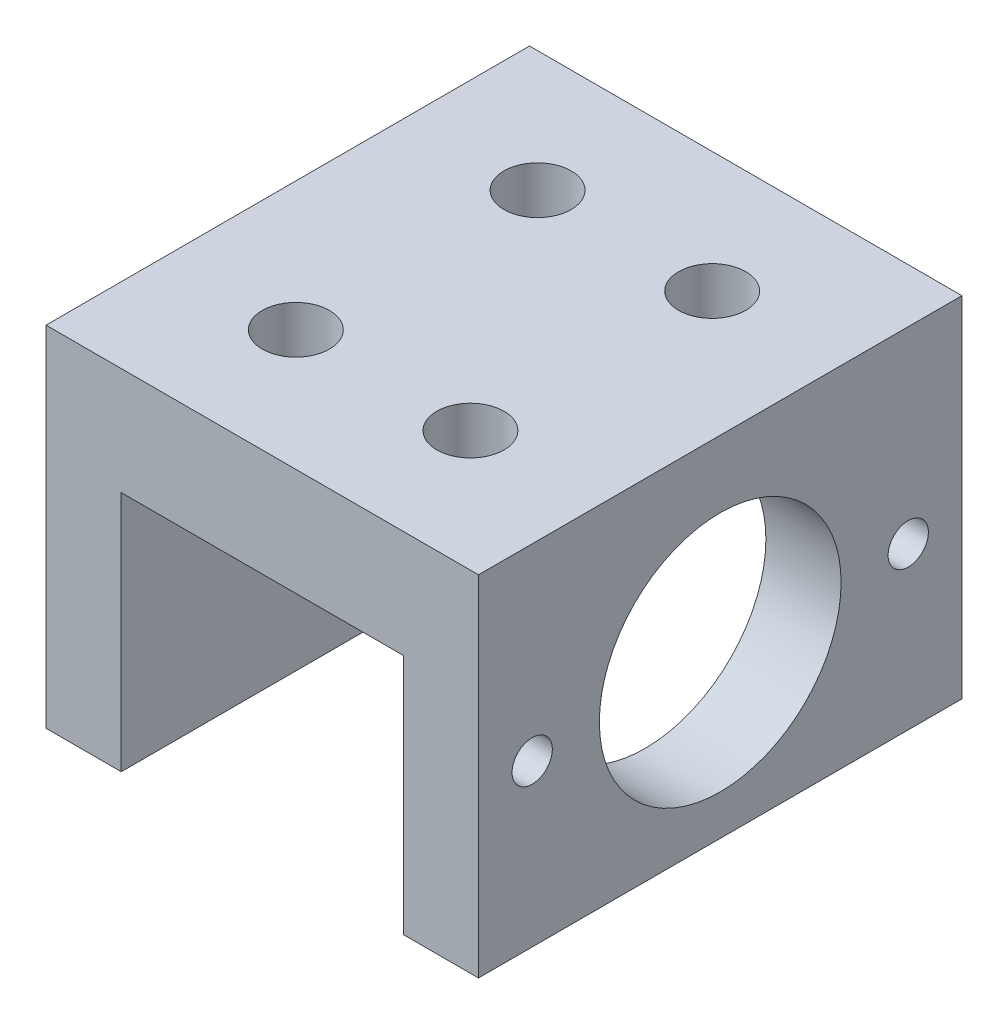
ISO-10303-21;
HEADER;
FILE_DESCRIPTION(('STEP AP214'),'2;1');
FILE_NAME('part.step','',(''),(''),'','','');
FILE_SCHEMA(('AUTOMOTIVE_DESIGN { 1 0 10303 214 1 1 1 1 }'));
ENDSEC;
DATA;
#1=APPLICATION_CONTEXT('core data for automotive mechanical design processes');
#2=APPLICATION_PROTOCOL_DEFINITION('international standard','automotive_design',2000,#1);
#3=PRODUCT_CONTEXT('',#1,'mechanical');
#4=PRODUCT('Part','Part','',(#3));
#5=PRODUCT_RELATED_PRODUCT_CATEGORY('part','',(#4));
#6=PRODUCT_DEFINITION_FORMATION('','',#4);
#7=PRODUCT_DEFINITION_CONTEXT('part definition',#1,'design');
#8=PRODUCT_DEFINITION('design','',#6,#7);
#9=PRODUCT_DEFINITION_SHAPE('','',#8);
#10=(LENGTH_UNIT() NAMED_UNIT(*) SI_UNIT(.MILLI.,.METRE.));
#11=(NAMED_UNIT(*) PLANE_ANGLE_UNIT() SI_UNIT($,.RADIAN.));
#12=(NAMED_UNIT(*) SI_UNIT($,.STERADIAN.) SOLID_ANGLE_UNIT());
#13=UNCERTAINTY_MEASURE_WITH_UNIT(LENGTH_MEASURE(1.E-05),#10,'distance_accuracy_value','');
#14=(GEOMETRIC_REPRESENTATION_CONTEXT(3) GLOBAL_UNCERTAINTY_ASSIGNED_CONTEXT((#13)) GLOBAL_UNIT_ASSIGNED_CONTEXT((#10,
#11,#12)) REPRESENTATION_CONTEXT('',''));
#15=CARTESIAN_POINT('',(0.,0.,0.));
#16=DIRECTION('',(0.,0.,1.));
#17=DIRECTION('',(1.,0.,0.));
#18=AXIS2_PLACEMENT_3D('',#15,#16,#17);
#19=CARTESIAN_POINT('',(0.,-26.,0.));
#20=DIRECTION('',(0.,1.,0.));
#21=DIRECTION('',(0.,0.,1.));
#22=AXIS2_PLACEMENT_3D('',#19,#20,#21);
#23=PLANE('',#22);
#24=DIRECTION('',(1.,0.,0.));
#25=VECTOR('',#24,1.);
#26=CARTESIAN_POINT('',(-16.1,-26.,18.));
#27=LINE('',#26,#25);
#28=CARTESIAN_POINT('',(10.5,-26.,18.));
#29=VERTEX_POINT('',#28);
#30=CARTESIAN_POINT('',(16.1,-26.,18.));
#31=VERTEX_POINT('',#30);
#32=EDGE_CURVE('E149',#29,#31,#27,.T.);
#33=ORIENTED_EDGE('',*,*,#32,.F.);
#34=DIRECTION('',(0.,0.,-1.));
#35=VECTOR('',#34,1.);
#36=CARTESIAN_POINT('',(10.5,-26.,18.));
#37=LINE('',#36,#35);
#38=CARTESIAN_POINT('',(10.5,-26.,-18.));
#39=VERTEX_POINT('',#38);
#40=EDGE_CURVE('E159',#29,#39,#37,.T.);
#41=ORIENTED_EDGE('',*,*,#40,.T.);
#42=DIRECTION('',(-1.,0.,0.));
#43=VECTOR('',#42,1.);
#44=CARTESIAN_POINT('',(16.1,-26.,-18.));
#45=LINE('',#44,#43);
#46=CARTESIAN_POINT('',(16.1,-26.,-18.));
#47=VERTEX_POINT('',#46);
#48=EDGE_CURVE('E153',#47,#39,#45,.T.);
#49=ORIENTED_EDGE('',*,*,#48,.F.);
#50=DIRECTION('',(0.,0.,-1.));
#51=VECTOR('',#50,1.);
#52=CARTESIAN_POINT('',(16.1,-26.,18.));
#53=LINE('',#52,#51);
#54=EDGE_CURVE('E136',#31,#47,#53,.T.);
#55=ORIENTED_EDGE('',*,*,#54,.F.);
#56=EDGE_LOOP('',(#33,#41,#49,#55));
#57=FACE_BOUND('',#56,.T.);
#58=ADVANCED_FACE('F16',(#57),#23,.F.);
#59=CARTESIAN_POINT('',(16.1,-26.,18.));
#60=DIRECTION('',(1.,0.,0.));
#61=DIRECTION('',(0.,0.,-1.));
#62=AXIS2_PLACEMENT_3D('',#59,#60,#61);
#63=PLANE('',#62);
#64=CARTESIAN_POINT('',(16.1,-14.,0.));
#65=DIRECTION('',(1.,0.,0.));
#66=DIRECTION('',(0.,0.,-1.));
#67=AXIS2_PLACEMENT_3D('',#64,#65,#66);
#68=CIRCLE('',#67,9.);
#69=CARTESIAN_POINT('',(16.1,-14.,-9.));
#70=VERTEX_POINT('',#69);
#71=EDGE_CURVE('E101',#70,#70,#68,.T.);
#72=ORIENTED_EDGE('',*,*,#71,.F.);
#73=EDGE_LOOP('',(#72));
#74=FACE_BOUND('',#73,.T.);
#75=CARTESIAN_POINT('',(16.1,-14.,14.));
#76=DIRECTION('',(1.,0.,0.));
#77=DIRECTION('',(0.,0.,-1.));
#78=AXIS2_PLACEMENT_3D('',#75,#76,#77);
#79=CIRCLE('',#78,1.49999999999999);
#80=CARTESIAN_POINT('',(16.1,-14.,12.5));
#81=VERTEX_POINT('',#80);
#82=EDGE_CURVE('E124',#81,#81,#79,.T.);
#83=ORIENTED_EDGE('',*,*,#82,.F.);
#84=EDGE_LOOP('',(#83));
#85=FACE_BOUND('',#84,.T.);
#86=CARTESIAN_POINT('',(16.1,-14.,-14.));
#87=DIRECTION('',(1.,0.,0.));
#88=DIRECTION('',(0.,0.,-1.));
#89=AXIS2_PLACEMENT_3D('',#86,#87,#88);
#90=CIRCLE('',#89,1.49999999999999);
#91=CARTESIAN_POINT('',(16.1,-14.,-15.5));
#92=VERTEX_POINT('',#91);
#93=EDGE_CURVE('E185',#92,#92,#90,.T.);
#94=ORIENTED_EDGE('',*,*,#93,.F.);
#95=EDGE_LOOP('',(#94));
#96=FACE_BOUND('',#95,.T.);
#97=DIRECTION('',(0.,0.,-1.));
#98=VECTOR('',#97,1.);
#99=CARTESIAN_POINT('',(16.1,0.,18.));
#100=LINE('',#99,#98);
#101=CARTESIAN_POINT('',(16.1,0.,18.));
#102=VERTEX_POINT('',#101);
#103=CARTESIAN_POINT('',(16.1,0.,-18.));
#104=VERTEX_POINT('',#103);
#105=EDGE_CURVE('E143',#102,#104,#100,.T.);
#106=ORIENTED_EDGE('',*,*,#105,.F.);
#107=DIRECTION('',(0.,1.,0.));
#108=VECTOR('',#107,1.);
#109=CARTESIAN_POINT('',(16.1,-26.,18.));
#110=LINE('',#109,#108);
#111=EDGE_CURVE('E95',#31,#102,#110,.T.);
#112=ORIENTED_EDGE('',*,*,#111,.F.);
#113=ORIENTED_EDGE('',*,*,#54,.T.);
#114=DIRECTION('',(0.,1.,0.));
#115=VECTOR('',#114,1.);
#116=CARTESIAN_POINT('',(16.1,-26.,-18.));
#117=LINE('',#116,#115);
#118=EDGE_CURVE('E125',#47,#104,#117,.T.);
#119=ORIENTED_EDGE('',*,*,#118,.T.);
#120=EDGE_LOOP('',(#106,#112,#113,#119));
#121=FACE_BOUND('',#120,.T.);
#122=ADVANCED_FACE('F18',(#74,#85,#96,#121),#63,.T.);
#123=CARTESIAN_POINT('',(-16.1,-26.,18.));
#124=DIRECTION('',(0.,0.,1.));
#125=DIRECTION('',(1.,0.,0.));
#126=AXIS2_PLACEMENT_3D('',#123,#124,#125);
#127=PLANE('',#126);
#128=DIRECTION('',(0.,-1.,0.));
#129=VECTOR('',#128,1.);
#130=CARTESIAN_POINT('',(10.5,-8.,18.));
#131=LINE('',#130,#129);
#132=CARTESIAN_POINT('',(10.5,-8.,18.));
#133=VERTEX_POINT('',#132);
#134=EDGE_CURVE('E171',#133,#29,#131,.T.);
#135=ORIENTED_EDGE('',*,*,#134,.T.);
#136=ORIENTED_EDGE('',*,*,#32,.T.);
#137=ORIENTED_EDGE('',*,*,#111,.T.);
#138=DIRECTION('',(1.,0.,0.));
#139=VECTOR('',#138,1.);
#140=CARTESIAN_POINT('',(-16.1,0.,18.));
#141=LINE('',#140,#139);
#142=CARTESIAN_POINT('',(-16.1,0.,18.));
#143=VERTEX_POINT('',#142);
#144=EDGE_CURVE('E133',#143,#102,#141,.T.);
#145=ORIENTED_EDGE('',*,*,#144,.F.);
#146=DIRECTION('',(0.,1.,0.));
#147=VECTOR('',#146,1.);
#148=CARTESIAN_POINT('',(-16.1,-26.,18.));
#149=LINE('',#148,#147);
#150=CARTESIAN_POINT('',(-16.1,-26.,18.));
#151=VERTEX_POINT('',#150);
#152=EDGE_CURVE('E130',#151,#143,#149,.T.);
#153=ORIENTED_EDGE('',*,*,#152,.F.);
#154=CARTESIAN_POINT('',(-10.5,-26.,18.));
#155=VERTEX_POINT('',#154);
#156=EDGE_CURVE('E128',#151,#155,#27,.T.);
#157=ORIENTED_EDGE('',*,*,#156,.T.);
#158=DIRECTION('',(0.,1.,0.));
#159=VECTOR('',#158,1.);
#160=CARTESIAN_POINT('',(-10.5,-26.,18.));
#161=LINE('',#160,#159);
#162=CARTESIAN_POINT('',(-10.5,-8.,18.));
#163=VERTEX_POINT('',#162);
#164=EDGE_CURVE('E38',#155,#163,#161,.T.);
#165=ORIENTED_EDGE('',*,*,#164,.T.);
#166=DIRECTION('',(1.,0.,0.));
#167=VECTOR('',#166,1.);
#168=CARTESIAN_POINT('',(-10.5,-8.,18.));
#169=LINE('',#168,#167);
#170=EDGE_CURVE('E163',#163,#133,#169,.T.);
#171=ORIENTED_EDGE('',*,*,#170,.T.);
#172=EDGE_LOOP('',(#135,#136,#137,#145,#153,#157,#165,#171));
#173=FACE_BOUND('',#172,.T.);
#174=ADVANCED_FACE('F208',(#173),#127,.T.);
#175=CARTESIAN_POINT('',(-16.1,-26.,-18.));
#176=DIRECTION('',(-1.,0.,0.));
#177=DIRECTION('',(0.,0.,1.));
#178=AXIS2_PLACEMENT_3D('',#175,#176,#177);
#179=PLANE('',#178);
#180=DIRECTION('',(0.,0.,1.));
#181=VECTOR('',#180,1.);
#182=CARTESIAN_POINT('',(-16.1,0.,-18.));
#183=LINE('',#182,#181);
#184=CARTESIAN_POINT('',(-16.1,0.,-18.));
#185=VERTEX_POINT('',#184);
#186=EDGE_CURVE('E137',#185,#143,#183,.T.);
#187=ORIENTED_EDGE('',*,*,#186,.F.);
#188=DIRECTION('',(0.,1.,0.));
#189=VECTOR('',#188,1.);
#190=CARTESIAN_POINT('',(-16.1,-26.,-18.));
#191=LINE('',#190,#189);
#192=CARTESIAN_POINT('',(-16.1,-26.,-18.));
#193=VERTEX_POINT('',#192);
#194=EDGE_CURVE('E127',#193,#185,#191,.T.);
#195=ORIENTED_EDGE('',*,*,#194,.F.);
#196=DIRECTION('',(0.,0.,1.));
#197=VECTOR('',#196,1.);
#198=CARTESIAN_POINT('',(-16.1,-26.,-18.));
#199=LINE('',#198,#197);
#200=EDGE_CURVE('E150',#193,#151,#199,.T.);
#201=ORIENTED_EDGE('',*,*,#200,.T.);
#202=ORIENTED_EDGE('',*,*,#152,.T.);
#203=EDGE_LOOP('',(#187,#195,#201,#202));
#204=FACE_BOUND('',#203,.T.);
#205=ADVANCED_FACE('F235',(#204),#179,.T.);
#206=CARTESIAN_POINT('',(16.1,-26.,-18.));
#207=DIRECTION('',(0.,0.,-1.));
#208=DIRECTION('',(-1.,0.,0.));
#209=AXIS2_PLACEMENT_3D('',#206,#207,#208);
#210=PLANE('',#209);
#211=DIRECTION('',(0.,-1.,0.));
#212=VECTOR('',#211,1.);
#213=CARTESIAN_POINT('',(10.5,-8.,-18.));
#214=LINE('',#213,#212);
#215=CARTESIAN_POINT('',(10.5,-8.,-18.));
#216=VERTEX_POINT('',#215);
#217=EDGE_CURVE('E175',#216,#39,#214,.T.);
#218=ORIENTED_EDGE('',*,*,#217,.F.);
#219=DIRECTION('',(1.,0.,0.));
#220=VECTOR('',#219,1.);
#221=CARTESIAN_POINT('',(-10.5,-8.,-18.));
#222=LINE('',#221,#220);
#223=CARTESIAN_POINT('',(-10.5,-8.,-18.));
#224=VERTEX_POINT('',#223);
#225=EDGE_CURVE('E169',#224,#216,#222,.T.);
#226=ORIENTED_EDGE('',*,*,#225,.F.);
#227=DIRECTION('',(0.,1.,0.));
#228=VECTOR('',#227,1.);
#229=CARTESIAN_POINT('',(-10.5,-26.,-18.));
#230=LINE('',#229,#228);
#231=CARTESIAN_POINT('',(-10.5,-26.,-18.));
#232=VERTEX_POINT('',#231);
#233=EDGE_CURVE('E172',#232,#224,#230,.T.);
#234=ORIENTED_EDGE('',*,*,#233,.F.);
#235=EDGE_CURVE('E156',#232,#193,#45,.T.);
#236=ORIENTED_EDGE('',*,*,#235,.T.);
#237=ORIENTED_EDGE('',*,*,#194,.T.);
#238=DIRECTION('',(-1.,0.,0.));
#239=VECTOR('',#238,1.);
#240=CARTESIAN_POINT('',(16.1,0.,-18.));
#241=LINE('',#240,#239);
#242=EDGE_CURVE('E140',#104,#185,#241,.T.);
#243=ORIENTED_EDGE('',*,*,#242,.F.);
#244=ORIENTED_EDGE('',*,*,#118,.F.);
#245=ORIENTED_EDGE('',*,*,#48,.T.);
#246=EDGE_LOOP('',(#218,#226,#234,#236,#237,#243,#244,#245));
#247=FACE_BOUND('',#246,.T.);
#248=ADVANCED_FACE('F228',(#247),#210,.T.);
#249=ORIENTED_EDGE('',*,*,#235,.F.);
#250=DIRECTION('',(0.,0.,-1.));
#251=VECTOR('',#250,1.);
#252=CARTESIAN_POINT('',(-10.5,-26.,18.));
#253=LINE('',#252,#251);
#254=EDGE_CURVE('E162',#155,#232,#253,.T.);
#255=ORIENTED_EDGE('',*,*,#254,.F.);
#256=ORIENTED_EDGE('',*,*,#156,.F.);
#257=ORIENTED_EDGE('',*,*,#200,.F.);
#258=EDGE_LOOP('',(#249,#255,#256,#257));
#259=FACE_BOUND('',#258,.T.);
#260=ADVANCED_FACE('F238',(#259),#23,.F.);
#261=CARTESIAN_POINT('',(0.,0.,0.));
#262=DIRECTION('',(0.,1.,0.));
#263=DIRECTION('',(0.,0.,1.));
#264=AXIS2_PLACEMENT_3D('',#261,#262,#263);
#265=PLANE('',#264);
#266=CARTESIAN_POINT('',(6.5,0.,9.));
#267=DIRECTION('',(0.,1.,0.));
#268=DIRECTION('',(0.,0.,1.));
#269=AXIS2_PLACEMENT_3D('',#266,#267,#268);
#270=CIRCLE('',#269,2.5);
#271=CARTESIAN_POINT('',(6.5,0.,11.5));
#272=VERTEX_POINT('',#271);
#273=EDGE_CURVE('E112',#272,#272,#270,.T.);
#274=ORIENTED_EDGE('',*,*,#273,.F.);
#275=EDGE_LOOP('',(#274));
#276=FACE_BOUND('',#275,.T.);
#277=CARTESIAN_POINT('',(-6.5,0.,9.));
#278=DIRECTION('',(0.,1.,0.));
#279=DIRECTION('',(0.,0.,1.));
#280=AXIS2_PLACEMENT_3D('',#277,#278,#279);
#281=CIRCLE('',#280,2.5);
#282=CARTESIAN_POINT('',(-6.5,0.,11.5));
#283=VERTEX_POINT('',#282);
#284=EDGE_CURVE('E111',#283,#283,#281,.T.);
#285=ORIENTED_EDGE('',*,*,#284,.F.);
#286=EDGE_LOOP('',(#285));
#287=FACE_BOUND('',#286,.T.);
#288=CARTESIAN_POINT('',(-6.5,0.,-9.));
#289=DIRECTION('',(0.,1.,0.));
#290=DIRECTION('',(0.,0.,1.));
#291=AXIS2_PLACEMENT_3D('',#288,#289,#290);
#292=CIRCLE('',#291,2.5);
#293=CARTESIAN_POINT('',(-6.5,0.,-6.5));
#294=VERTEX_POINT('',#293);
#295=EDGE_CURVE('E116',#294,#294,#292,.T.);
#296=ORIENTED_EDGE('',*,*,#295,.F.);
#297=EDGE_LOOP('',(#296));
#298=FACE_BOUND('',#297,.T.);
#299=CARTESIAN_POINT('',(6.5,0.,-9.));
#300=DIRECTION('',(0.,1.,0.));
#301=DIRECTION('',(0.,0.,1.));
#302=AXIS2_PLACEMENT_3D('',#299,#300,#301);
#303=CIRCLE('',#302,2.5);
#304=CARTESIAN_POINT('',(6.5,0.,-6.5));
#305=VERTEX_POINT('',#304);
#306=EDGE_CURVE('E120',#305,#305,#303,.T.);
#307=ORIENTED_EDGE('',*,*,#306,.F.);
#308=EDGE_LOOP('',(#307));
#309=FACE_BOUND('',#308,.T.);
#310=ORIENTED_EDGE('',*,*,#105,.T.);
#311=ORIENTED_EDGE('',*,*,#242,.T.);
#312=ORIENTED_EDGE('',*,*,#186,.T.);
#313=ORIENTED_EDGE('',*,*,#144,.T.);
#314=EDGE_LOOP('',(#310,#311,#312,#313));
#315=FACE_BOUND('',#314,.T.);
#316=ADVANCED_FACE('F219',(#276,#287,#298,#309,#315),#265,.T.);
#317=CARTESIAN_POINT('',(10.5,-8.,18.));
#318=DIRECTION('',(1.,0.,0.));
#319=DIRECTION('',(0.,0.,-1.));
#320=AXIS2_PLACEMENT_3D('',#317,#318,#319);
#321=PLANE('',#320);
#322=CARTESIAN_POINT('',(10.5,-14.,14.));
#323=DIRECTION('',(1.,0.,0.));
#324=DIRECTION('',(0.,0.,-1.));
#325=AXIS2_PLACEMENT_3D('',#322,#323,#324);
#326=CIRCLE('',#325,1.5);
#327=CARTESIAN_POINT('',(10.5,-14.,12.5));
#328=VERTEX_POINT('',#327);
#329=EDGE_CURVE('E188',#328,#328,#326,.T.);
#330=ORIENTED_EDGE('',*,*,#329,.T.);
#331=EDGE_LOOP('',(#330));
#332=FACE_BOUND('',#331,.T.);
#333=CARTESIAN_POINT('',(10.5,-14.,-14.));
#334=DIRECTION('',(1.,0.,0.));
#335=DIRECTION('',(0.,0.,-1.));
#336=AXIS2_PLACEMENT_3D('',#333,#334,#335);
#337=CIRCLE('',#336,1.5);
#338=CARTESIAN_POINT('',(10.5,-14.,-15.5));
#339=VERTEX_POINT('',#338);
#340=EDGE_CURVE('E177',#339,#339,#337,.T.);
#341=ORIENTED_EDGE('',*,*,#340,.T.);
#342=EDGE_LOOP('',(#341));
#343=FACE_BOUND('',#342,.T.);
#344=DIRECTION('',(0.,0.,-1.));
#345=VECTOR('',#344,1.);
#346=CARTESIAN_POINT('',(10.5,-8.,18.));
#347=LINE('',#346,#345);
#348=CARTESIAN_POINT('',(10.5,-8.,6.70820393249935));
#349=VERTEX_POINT('',#348);
#350=EDGE_CURVE('E146',#133,#349,#347,.T.);
#351=ORIENTED_EDGE('',*,*,#350,.T.);
#352=CARTESIAN_POINT('',(10.5,-14.,0.));
#353=DIRECTION('',(1.,0.,0.));
#354=DIRECTION('',(0.,0.,-1.));
#355=AXIS2_PLACEMENT_3D('',#352,#353,#354);
#356=CIRCLE('',#355,9.);
#357=CARTESIAN_POINT('',(10.5,-8.,-6.70820393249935));
#358=VERTEX_POINT('',#357);
#359=EDGE_CURVE('E100',#349,#358,#356,.T.);
#360=ORIENTED_EDGE('',*,*,#359,.T.);
#361=EDGE_CURVE('E106',#358,#216,#347,.T.);
#362=ORIENTED_EDGE('',*,*,#361,.T.);
#363=ORIENTED_EDGE('',*,*,#217,.T.);
#364=ORIENTED_EDGE('',*,*,#40,.F.);
#365=ORIENTED_EDGE('',*,*,#134,.F.);
#366=EDGE_LOOP('',(#351,#360,#362,#363,#364,#365));
#367=FACE_BOUND('',#366,.T.);
#368=ADVANCED_FACE('F241',(#332,#343,#367),#321,.F.);
#369=CARTESIAN_POINT('',(-10.5,-8.,18.));
#370=DIRECTION('',(0.,1.,0.));
#371=DIRECTION('',(0.,0.,1.));
#372=AXIS2_PLACEMENT_3D('',#369,#370,#371);
#373=PLANE('',#372);
#374=CARTESIAN_POINT('',(6.5,-8.,9.));
#375=DIRECTION('',(0.,1.,0.));
#376=DIRECTION('',(0.,0.,1.));
#377=AXIS2_PLACEMENT_3D('',#374,#375,#376);
#378=CIRCLE('',#377,2.5);
#379=CARTESIAN_POINT('',(6.5,-8.,11.5));
#380=VERTEX_POINT('',#379);
#381=EDGE_CURVE('E108',#380,#380,#378,.T.);
#382=ORIENTED_EDGE('',*,*,#381,.T.);
#383=EDGE_LOOP('',(#382));
#384=FACE_BOUND('',#383,.T.);
#385=CARTESIAN_POINT('',(-6.5,-8.,9.));
#386=DIRECTION('',(0.,1.,0.));
#387=DIRECTION('',(0.,0.,1.));
#388=AXIS2_PLACEMENT_3D('',#385,#386,#387);
#389=CIRCLE('',#388,2.5);
#390=CARTESIAN_POINT('',(-6.5,-8.,11.5));
#391=VERTEX_POINT('',#390);
#392=EDGE_CURVE('E113',#391,#391,#389,.T.);
#393=ORIENTED_EDGE('',*,*,#392,.T.);
#394=EDGE_LOOP('',(#393));
#395=FACE_BOUND('',#394,.T.);
#396=CARTESIAN_POINT('',(-6.5,-8.,-9.));
#397=DIRECTION('',(0.,1.,0.));
#398=DIRECTION('',(0.,0.,1.));
#399=AXIS2_PLACEMENT_3D('',#396,#397,#398);
#400=CIRCLE('',#399,2.5);
#401=CARTESIAN_POINT('',(-6.5,-8.,-6.5));
#402=VERTEX_POINT('',#401);
#403=EDGE_CURVE('E117',#402,#402,#400,.T.);
#404=ORIENTED_EDGE('',*,*,#403,.T.);
#405=EDGE_LOOP('',(#404));
#406=FACE_BOUND('',#405,.T.);
#407=CARTESIAN_POINT('',(6.5,-8.,-9.));
#408=DIRECTION('',(0.,1.,0.));
#409=DIRECTION('',(0.,0.,1.));
#410=AXIS2_PLACEMENT_3D('',#407,#408,#409);
#411=CIRCLE('',#410,2.5);
#412=CARTESIAN_POINT('',(6.5,-8.,-6.5));
#413=VERTEX_POINT('',#412);
#414=EDGE_CURVE('E121',#413,#413,#411,.T.);
#415=ORIENTED_EDGE('',*,*,#414,.T.);
#416=EDGE_LOOP('',(#415));
#417=FACE_BOUND('',#416,.T.);
#418=DIRECTION('',(0.,0.,1.));
#419=VECTOR('',#418,1.);
#420=CARTESIAN_POINT('',(9.1,-8.,18.));
#421=LINE('',#420,#419);
#422=CARTESIAN_POINT('',(9.1,-8.,-6.70820393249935));
#423=VERTEX_POINT('',#422);
#424=CARTESIAN_POINT('',(9.1,-8.,6.70820393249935));
#425=VERTEX_POINT('',#424);
#426=EDGE_CURVE('E91',#423,#425,#421,.T.);
#427=ORIENTED_EDGE('',*,*,#426,.T.);
#428=DIRECTION('',(1.,0.,0.));
#429=VECTOR('',#428,1.);
#430=CARTESIAN_POINT('',(16.1,-8.,6.70820393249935));
#431=LINE('',#430,#429);
#432=EDGE_CURVE('E10',#425,#349,#431,.T.);
#433=ORIENTED_EDGE('',*,*,#432,.T.);
#434=ORIENTED_EDGE('',*,*,#350,.F.);
#435=ORIENTED_EDGE('',*,*,#170,.F.);
#436=DIRECTION('',(0.,0.,-1.));
#437=VECTOR('',#436,1.);
#438=CARTESIAN_POINT('',(-10.5,-8.,18.));
#439=LINE('',#438,#437);
#440=EDGE_CURVE('E165',#163,#224,#439,.T.);
#441=ORIENTED_EDGE('',*,*,#440,.T.);
#442=ORIENTED_EDGE('',*,*,#225,.T.);
#443=ORIENTED_EDGE('',*,*,#361,.F.);
#444=DIRECTION('',(1.,0.,0.));
#445=VECTOR('',#444,1.);
#446=CARTESIAN_POINT('',(16.1,-8.,-6.70820393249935));
#447=LINE('',#446,#445);
#448=EDGE_CURVE('E24',#358,#423,#447,.F.);
#449=ORIENTED_EDGE('',*,*,#448,.T.);
#450=EDGE_LOOP('',(#427,#433,#434,#435,#441,#442,#443,#449));
#451=FACE_BOUND('',#450,.T.);
#452=ADVANCED_FACE('F104',(#384,#395,#406,#417,#451),#373,.F.);
#453=CARTESIAN_POINT('',(-10.5,-26.,18.));
#454=DIRECTION('',(-1.,0.,0.));
#455=DIRECTION('',(0.,0.,1.));
#456=AXIS2_PLACEMENT_3D('',#453,#454,#455);
#457=PLANE('',#456);
#458=ORIENTED_EDGE('',*,*,#233,.T.);
#459=ORIENTED_EDGE('',*,*,#440,.F.);
#460=ORIENTED_EDGE('',*,*,#164,.F.);
#461=ORIENTED_EDGE('',*,*,#254,.T.);
#462=EDGE_LOOP('',(#458,#459,#460,#461));
#463=FACE_BOUND('',#462,.T.);
#464=ADVANCED_FACE('F242',(#463),#457,.F.);
#465=CARTESIAN_POINT('',(16.1,-14.,-14.));
#466=DIRECTION('',(1.,0.,0.));
#467=DIRECTION('',(0.,0.,-1.));
#468=AXIS2_PLACEMENT_3D('',#465,#466,#467);
#469=CYLINDRICAL_SURFACE('',#468,1.5);
#470=ORIENTED_EDGE('',*,*,#340,.F.);
#471=EDGE_LOOP('',(#470));
#472=FACE_BOUND('',#471,.T.);
#473=ORIENTED_EDGE('',*,*,#93,.T.);
#474=EDGE_LOOP('',(#473));
#475=FACE_BOUND('',#474,.T.);
#476=ADVANCED_FACE('F244',(#472,#475),#469,.F.);
#477=CARTESIAN_POINT('',(16.1,-14.,14.));
#478=DIRECTION('',(1.,0.,0.));
#479=DIRECTION('',(0.,0.,-1.));
#480=AXIS2_PLACEMENT_3D('',#477,#478,#479);
#481=CYLINDRICAL_SURFACE('',#480,1.5);
#482=ORIENTED_EDGE('',*,*,#329,.F.);
#483=EDGE_LOOP('',(#482));
#484=FACE_BOUND('',#483,.T.);
#485=ORIENTED_EDGE('',*,*,#82,.T.);
#486=EDGE_LOOP('',(#485));
#487=FACE_BOUND('',#486,.T.);
#488=ADVANCED_FACE('F252',(#484,#487),#481,.F.);
#489=CARTESIAN_POINT('',(6.5,0.,-9.));
#490=DIRECTION('',(0.,1.,0.));
#491=DIRECTION('',(0.,0.,1.));
#492=AXIS2_PLACEMENT_3D('',#489,#490,#491);
#493=CYLINDRICAL_SURFACE('',#492,2.5);
#494=ORIENTED_EDGE('',*,*,#306,.T.);
#495=EDGE_LOOP('',(#494));
#496=FACE_BOUND('',#495,.T.);
#497=ORIENTED_EDGE('',*,*,#414,.F.);
#498=EDGE_LOOP('',(#497));
#499=FACE_BOUND('',#498,.T.);
#500=ADVANCED_FACE('F318',(#496,#499),#493,.F.);
#501=CARTESIAN_POINT('',(-6.5,0.,-9.));
#502=DIRECTION('',(0.,1.,0.));
#503=DIRECTION('',(0.,0.,1.));
#504=AXIS2_PLACEMENT_3D('',#501,#502,#503);
#505=CYLINDRICAL_SURFACE('',#504,2.5);
#506=ORIENTED_EDGE('',*,*,#295,.T.);
#507=EDGE_LOOP('',(#506));
#508=FACE_BOUND('',#507,.T.);
#509=ORIENTED_EDGE('',*,*,#403,.F.);
#510=EDGE_LOOP('',(#509));
#511=FACE_BOUND('',#510,.T.);
#512=ADVANCED_FACE('F326',(#508,#511),#505,.F.);
#513=CARTESIAN_POINT('',(-6.5,0.,9.));
#514=DIRECTION('',(0.,1.,0.));
#515=DIRECTION('',(0.,0.,1.));
#516=AXIS2_PLACEMENT_3D('',#513,#514,#515);
#517=CYLINDRICAL_SURFACE('',#516,2.5);
#518=ORIENTED_EDGE('',*,*,#284,.T.);
#519=EDGE_LOOP('',(#518));
#520=FACE_BOUND('',#519,.T.);
#521=ORIENTED_EDGE('',*,*,#392,.F.);
#522=EDGE_LOOP('',(#521));
#523=FACE_BOUND('',#522,.T.);
#524=ADVANCED_FACE('F334',(#520,#523),#517,.F.);
#525=CARTESIAN_POINT('',(6.5,0.,9.));
#526=DIRECTION('',(0.,1.,0.));
#527=DIRECTION('',(0.,0.,1.));
#528=AXIS2_PLACEMENT_3D('',#525,#526,#527);
#529=CYLINDRICAL_SURFACE('',#528,2.5);
#530=ORIENTED_EDGE('',*,*,#273,.T.);
#531=EDGE_LOOP('',(#530));
#532=FACE_BOUND('',#531,.T.);
#533=ORIENTED_EDGE('',*,*,#381,.F.);
#534=EDGE_LOOP('',(#533));
#535=FACE_BOUND('',#534,.T.);
#536=ADVANCED_FACE('F342',(#532,#535),#529,.F.);
#537=CARTESIAN_POINT('',(16.1,-14.,0.));
#538=DIRECTION('',(1.,0.,0.));
#539=DIRECTION('',(0.,0.,-1.));
#540=AXIS2_PLACEMENT_3D('',#537,#538,#539);
#541=CYLINDRICAL_SURFACE('',#540,9.);
#542=ORIENTED_EDGE('',*,*,#71,.T.);
#543=EDGE_LOOP('',(#542));
#544=FACE_BOUND('',#543,.T.);
#545=CARTESIAN_POINT('',(9.1,-14.,0.));
#546=DIRECTION('',(1.,0.,0.));
#547=DIRECTION('',(0.,0.,-1.));
#548=AXIS2_PLACEMENT_3D('',#545,#546,#547);
#549=CIRCLE('',#548,9.);
#550=EDGE_CURVE('E30',#423,#425,#549,.T.);
#551=ORIENTED_EDGE('',*,*,#550,.F.);
#552=ORIENTED_EDGE('',*,*,#448,.F.);
#553=ORIENTED_EDGE('',*,*,#359,.F.);
#554=ORIENTED_EDGE('',*,*,#432,.F.);
#555=EDGE_LOOP('',(#551,#552,#553,#554));
#556=FACE_BOUND('',#555,.T.);
#557=ADVANCED_FACE('F98',(#544,#556),#541,.F.);
#558=CARTESIAN_POINT('',(9.1,-14.,0.));
#559=DIRECTION('',(-1.,0.,0.));
#560=DIRECTION('',(0.,0.,1.));
#561=AXIS2_PLACEMENT_3D('',#558,#559,#560);
#562=PLANE('',#561);
#563=ORIENTED_EDGE('',*,*,#550,.T.);
#564=ORIENTED_EDGE('',*,*,#426,.F.);
#565=EDGE_LOOP('',(#563,#564));
#566=FACE_BOUND('',#565,.T.);
#567=ADVANCED_FACE('F92',(#566),#562,.F.);
#568=CLOSED_SHELL('',(#58,#122,#174,#205,#248,#260,#316,#368,#452,#464,#476,#488,#500,#512,#524,
#536,#557,#567));
#569=MANIFOLD_SOLID_BREP('B1',#568);
#570=ADVANCED_BREP_SHAPE_REPRESENTATION('',(#18,#569),#14);
#571=SHAPE_DEFINITION_REPRESENTATION(#9,#570);
ENDSEC;
END-ISO-10303-21;
